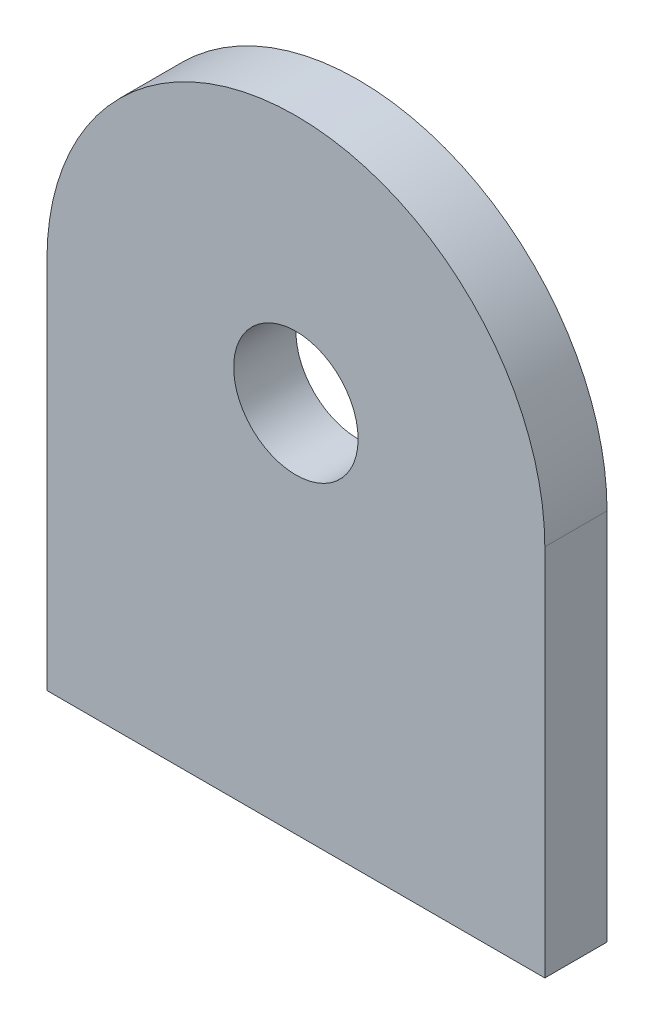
from build123d import *

# Parameters (mm, degrees)
BOSS_EXTRUDE1_DEPTH = 3.175
SKETCH2_R           = 6.35
CUT_EXTRUDE1_DEPTH  = 42.152703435


with BuildPart() as part:
    # Sketch1 → Boss-Extrude1 (new, symmetric)
    with BuildSketch(Plane.XY):
        with BuildLine():
            Line((-25.4, 6.35), (-25.4, -31.75))
            Line((-25.4, -31.75), (25.4, -31.75))
            Line((25.4, -31.75), (25.4, 6.35))
            ThreePointArc((25.4, 6.35), (0, 31.75), (-25.4, 6.35))
        make_face()
    extrude(amount=BOSS_EXTRUDE1_DEPTH, both=True)

    # Sketch2 → Cut-Extrude1 (cut, through all)
    with BuildSketch(Plane.XY.offset(3.175)):
        with Locations((0, 6.35)):
            Circle(SKETCH2_R)
    extrude(amount=-CUT_EXTRUDE1_DEPTH, mode=Mode.SUBTRACT)


solid = part.part
